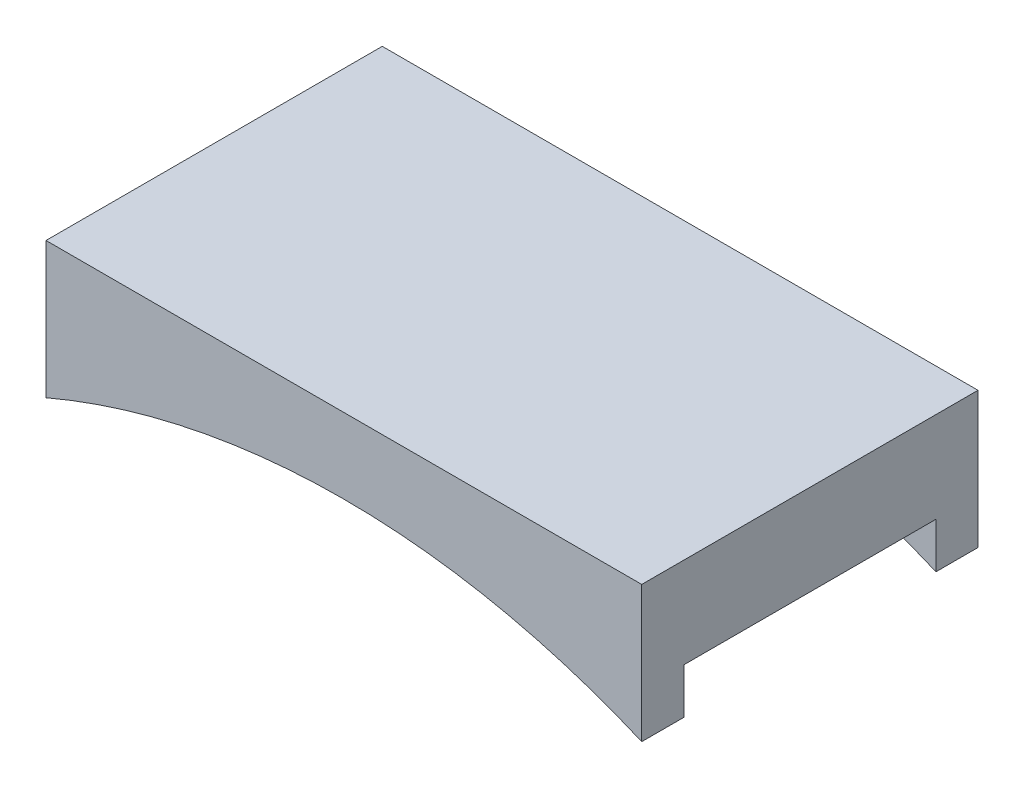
from build123d import *

# Parameters (mm, degrees)
BOSS_EXTRUDE1_DEPTH = 12.7
BOSS_EXTRUDE2_DEPTH = 3.175


with BuildPart() as part:
    # Sketch1 → Boss-Extrude1 (new, symmetric)
    with BuildSketch(Plane.XY):
        with BuildLine():
            Line((0, 0), (45, 0))
            Line((45, 0), (45, -6.85))
            ThreePointArc((45, -6.85), (22.5, -2.496918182), (0, -6.85))
            Line((0, -6.85), (0, 0))
        make_face()
    extrude(amount=BOSS_EXTRUDE1_DEPTH, both=True)

    # Sketch2 → Boss-Extrude2 (add)
    with BuildSketch(Plane.XY.offset(12.7)):
        with BuildLine():
            Line((0, -10.287429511), (0, -6.85))
            ThreePointArc((0, -6.85), (22.5, -2.496918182), (45, -6.85))
            Line((45, -6.85), (45, -10.287429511))
            ThreePointArc((45, -10.287429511), (22.5, -5.671918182), (0, -10.287429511))
        make_face()
    boss_extrude2 = extrude(amount=-BOSS_EXTRUDE2_DEPTH)

    # Mirror1: Boss-Extrude2 across plane
    add(boss_extrude2.mirror(Plane.XY))


solid = part.part
